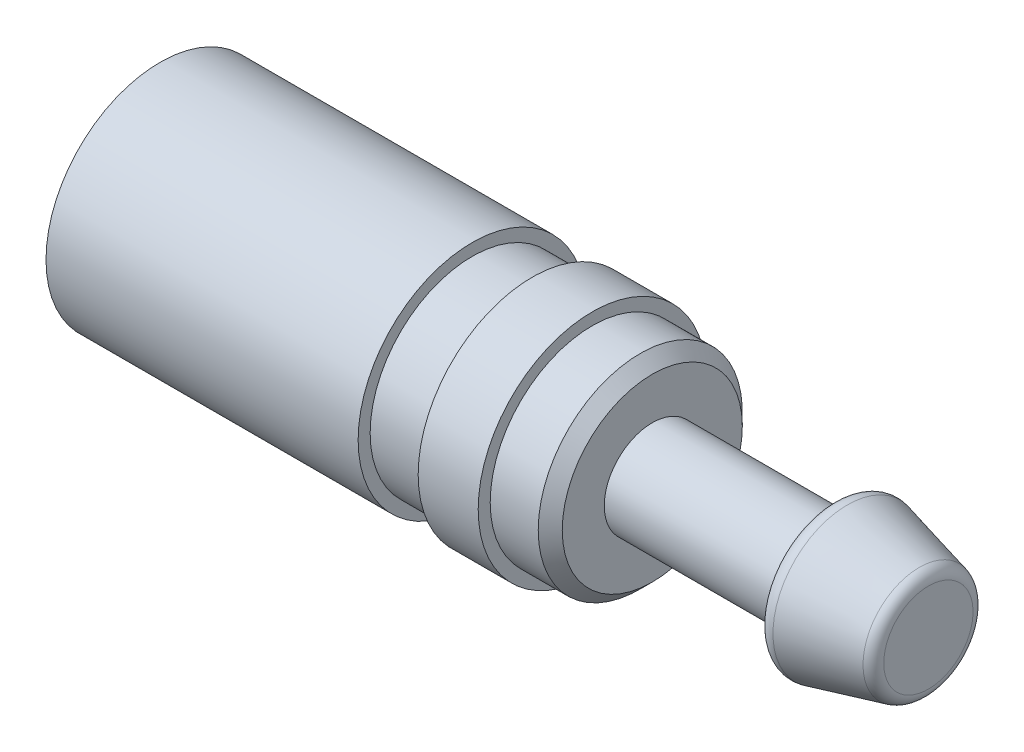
from build123d import *

# Parameters (mm, degrees)
REDONDEO1_R   = 1
CHAFL_N1_SIZE = 1


with BuildPart() as part:
    # Croquis1 → Revoluci_n1 (revolve)
    with BuildSketch(Plane.XY, mode=Mode.PRIVATE) as revoluci_n1_sk:
        Polygon((0, 0), (0, 9.5), (26, 9.5), (26, 8.5), (31, 8.5), (31, 9.5), (36, 9.5), (36, 8.5), (41, 8.5), (41, 4), (56, 4), (56, 6.5), (64, 4.5), (64, 0), align=None)
    revolve(revoluci_n1_sk.sketch.rotate(Axis((0, 0, 0), (1, 0, 0)), 90), axis=Axis((0, 0, 0), (1, 0, 0)))

    # Redondeo1
    redondeo1_edges = [part.edges().sort_by_distance(p)[0] for p in [
        (56, 0, -6.5),
        (64, 0, -4.5),
    ]]
    fillet(redondeo1_edges, radius=REDONDEO1_R)

    # Chafl_n1
    chafl_n1_edges = [part.edges().sort_by_distance(p)[0] for p in [
        (41, 0, -8.5),
    ]]
    chamfer(chafl_n1_edges, length=CHAFL_N1_SIZE)


solid = part.part
